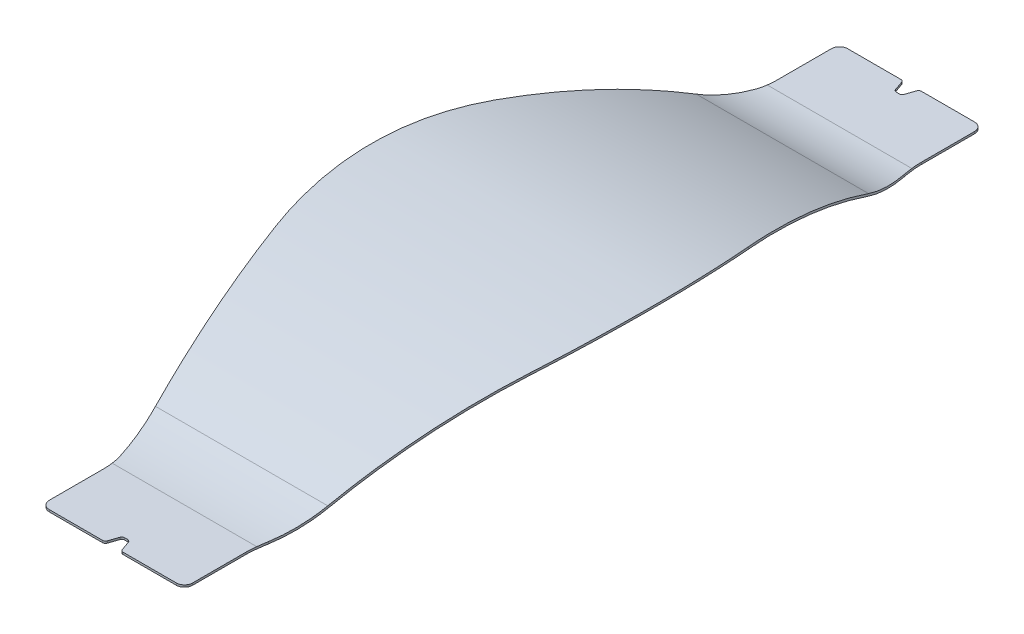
from build123d import *

# Parameters (mm, degrees)
EXTRUDE_THIN1_DEPTH   = 150
CUT_EXTRUDE3_DEPTH    = 426.254041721
MIRROR5_COPY_1_DEPTH  = 426.254041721
CUT_EXTRUDE4_DEPTH    = 100
MIRROR11_COPY_1_DEPTH = 100
FILLET4_R             = 3
FILLET5_R             = 8
SCALE2_SCALE          = 1.008


with BuildPart() as part:
    # Sketch4 → Extrude-Thin1 (new, symmetric)
    with BuildSketch(Plane(origin=(0, 0, 0), x_dir=(0, 0, -1), z_dir=(1, 0, 0))):
        with BuildLine():
            ThreePointArc((0, 77), (135.399378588, 60.93897595), (263.283885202, 13.647315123))
            ThreePointArc((263.283885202, 13.647315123), (290.832522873, 3.459835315), (320, 0))
            Line((320, 0), (390, 0))
            Line((390, 0), (390, 2))
            Line((390, 2), (320, 2))
            ThreePointArc((320, 2), (291.300417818, 5.40433379), (264.19370621, 15.428389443))
            ThreePointArc((264.19370621, 15.428389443), (135.867273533, 62.883474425), (0, 79))
            Line((0, 79), (0, 77))
        make_face()
    extrude_thin1 = extrude(amount=EXTRUDE_THIN1_DEPTH, both=True)

    # Mirror1: Extrude-Thin1 across plane
    add(extrude_thin1.mirror(Plane(origin=(150, 77, 0), x_dir=(1, 0, 0), z_dir=(0, 0, 1))))

    # Sketch5 → Cut-Extrude3 (cut, symmetric)
    with BuildSketch(Plane(origin=(0, 0, 0), x_dir=(1, 0, 0), z_dir=(0, 1, 0))):
        with BuildLine():
            Line((70, 390), (70, 330))
            ThreePointArc((70, 330), (70.617769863, 320.077221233), (72.461538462, 310.307692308))
            Line((72.461538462, 310.307692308), (124.153846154, 106.769230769))
            ThreePointArc((124.153846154, 106.769230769), (134.150529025, 53.800066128), (137.5, 0))
            Line((137.5, 0), (272.389394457, 0))
            Line((272.389394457, 0), (272.389394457, 527.639402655))
            Line((272.389394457, 527.639402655), (0, 527.639402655))
            Line((0, 527.639402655), (0, 390))
            Line((0, 390), (70, 390))
        make_face()
    cut_extrude3 = extrude(amount=CUT_EXTRUDE3_DEPTH, both=True, mode=Mode.SUBTRACT)

    # Mirror4: Cut-Extrude3 across plane
    add(cut_extrude3.mirror(Plane.XY), mode=Mode.SUBTRACT)

    # Mirror5: Cut-Extrude3 across plane
    add(cut_extrude3.mirror(Plane(origin=(0, 0, 0), x_dir=(0, 0, 1), z_dir=(1, 0, 0))), mode=Mode.SUBTRACT)

    # Mirror5 copy 1 sketch → Mirror5 copy 1 (cut, symmetric)
    with BuildSketch(Plane(origin=(0, 0, 0), x_dir=(-1, 0, 0), z_dir=(0, 1, 0))):
        with BuildLine():
            Line((70, 390), (70, 330))
            ThreePointArc((70, 330), (70.617769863, 320.077221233), (72.461538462, 310.307692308))
            Line((72.461538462, 310.307692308), (124.153846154, 106.769230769))
            ThreePointArc((124.153846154, 106.769230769), (134.150529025, 53.800066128), (137.5, 0))
            Line((137.5, 0), (272.389394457, 0))
            Line((272.389394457, 0), (272.389394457, 527.639402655))
            Line((272.389394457, 527.639402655), (0, 527.639402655))
            Line((0, 527.639402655), (0, 390))
            Line((0, 390), (70, 390))
        make_face()
    extrude(amount=MIRROR5_COPY_1_DEPTH, both=True, mode=Mode.SUBTRACT)

    # Sketch9 → Cut-Extrude4 (cut)
    with BuildSketch(Plane(origin=(0, 2, 0), x_dir=(1, 0, 0), z_dir=(0, 1, 0))):
        Polygon((0, 390), (0, 377), (3.5, 377), (8, 390), align=None)
    cut_extrude4 = extrude(amount=-CUT_EXTRUDE4_DEPTH, mode=Mode.SUBTRACT)

    # Mirror7: Cut-Extrude4 across plane
    add(cut_extrude4.mirror(Plane(origin=(0, 0, 0), x_dir=(0, 0, 1), z_dir=(1, 0, 0))), mode=Mode.SUBTRACT)

    # Mirror11: Cut-Extrude4 across plane
    add(cut_extrude4.mirror(Plane.XY), mode=Mode.SUBTRACT)

    # Mirror11 copy 1 sketch → Mirror11 copy 1 (cut)
    with BuildSketch(Plane(origin=(0, 2, 0), x_dir=(-1, 0, 0), z_dir=(0, 1, 0))):
        Polygon((0, 390), (0, 377), (3.5, 377), (8, 390), align=None)
    extrude(amount=-MIRROR11_COPY_1_DEPTH, mode=Mode.SUBTRACT)

    # Fillet4
    fillet4_edges = [part.edges().sort_by_distance(p)[0] for p in [
        (8, 1, -390),
        (3.5, 1, -377),
        (-3.5, 1, -377),
        (-8, 1, -390),
        (8, 1, 390),
        (3.5, 1, 377),
        (-8, 1, 390),
        (-3.5, 1, 377),
    ]]
    fillet(fillet4_edges, radius=FILLET4_R)

    # Fillet5
    fillet5_edges = [part.edges().sort_by_distance(p)[0] for p in [
        (70, 1, -390),
        (-70, 1, -390),
        (-70, 1, 390),
        (70, 1, 390),
    ]]
    fillet(fillet5_edges, radius=FILLET5_R)


with BuildPart() as part_1:
    # Scale2: scaled about (0, 46.645895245, 0)
    add(part.part.scale(SCALE2_SCALE).moved(Location((0, -0.373167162, 0))))


solid = part_1.part
